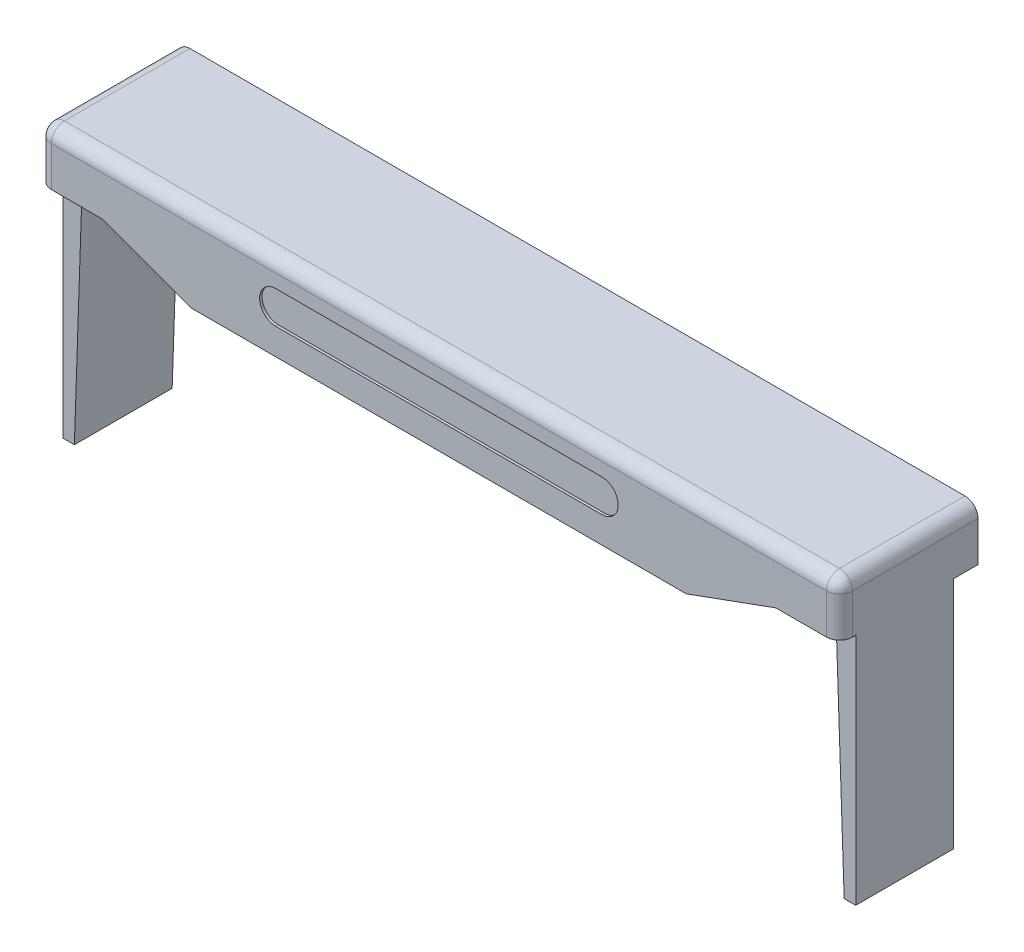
ISO-10303-21;
HEADER;
FILE_DESCRIPTION(('STEP AP214'),'2;1');
FILE_NAME('part.step','',(''),(''),'','','');
FILE_SCHEMA(('AUTOMOTIVE_DESIGN { 1 0 10303 214 1 1 1 1 }'));
ENDSEC;
DATA;
#1=APPLICATION_CONTEXT('core data for automotive mechanical design processes');
#2=APPLICATION_PROTOCOL_DEFINITION('international standard','automotive_design',2000,#1);
#3=PRODUCT_CONTEXT('',#1,'mechanical');
#4=PRODUCT('Part','Part','',(#3));
#5=PRODUCT_RELATED_PRODUCT_CATEGORY('part','',(#4));
#6=PRODUCT_DEFINITION_FORMATION('','',#4);
#7=PRODUCT_DEFINITION_CONTEXT('part definition',#1,'design');
#8=PRODUCT_DEFINITION('design','',#6,#7);
#9=PRODUCT_DEFINITION_SHAPE('','',#8);
#10=(LENGTH_UNIT() NAMED_UNIT(*) SI_UNIT(.MILLI.,.METRE.));
#11=(NAMED_UNIT(*) PLANE_ANGLE_UNIT() SI_UNIT($,.RADIAN.));
#12=(NAMED_UNIT(*) SI_UNIT($,.STERADIAN.) SOLID_ANGLE_UNIT());
#13=UNCERTAINTY_MEASURE_WITH_UNIT(LENGTH_MEASURE(1.E-05),#10,'distance_accuracy_value','');
#14=(GEOMETRIC_REPRESENTATION_CONTEXT(3) GLOBAL_UNCERTAINTY_ASSIGNED_CONTEXT((#13)) GLOBAL_UNIT_ASSIGNED_CONTEXT((#10,
#11,#12)) REPRESENTATION_CONTEXT('',''));
#15=CARTESIAN_POINT('',(0.,0.,0.));
#16=DIRECTION('',(0.,0.,1.));
#17=DIRECTION('',(1.,0.,0.));
#18=AXIS2_PLACEMENT_3D('',#15,#16,#17);
#19=CARTESIAN_POINT('',(0.,-4.,-5.5));
#20=DIRECTION('',(0.,0.,-1.));
#21=DIRECTION('',(0.,1.,0.));
#22=AXIS2_PLACEMENT_3D('',#19,#20,#21);
#23=PLANE('',#22);
#24=DIRECTION('',(-0.0340228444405,0.999421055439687,0.));
#25=VECTOR('',#24,1.);
#26=CARTESIAN_POINT('',(47.7270212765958,-28.7,-5.5));
#27=LINE('',#26,#25);
#28=CARTESIAN_POINT('',(47.7270212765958,-28.7,-5.5));
#29=VERTEX_POINT('',#28);
#30=CARTESIAN_POINT('',(46.75,0.,-5.5));
#31=VERTEX_POINT('',#30);
#32=EDGE_CURVE('E275',#29,#31,#27,.T.);
#33=ORIENTED_EDGE('',*,*,#32,.T.);
#34=DIRECTION('',(1.,0.,0.));
#35=VECTOR('',#34,1.);
#36=CARTESIAN_POINT('',(49.15,0.,-5.5));
#37=LINE('',#36,#35);
#38=CARTESIAN_POINT('',(49.15,0.,-5.5));
#39=VERTEX_POINT('',#38);
#40=EDGE_CURVE('E466',#31,#39,#37,.T.);
#41=ORIENTED_EDGE('',*,*,#40,.T.);
#42=DIRECTION('',(0.,-1.,0.));
#43=VECTOR('',#42,1.);
#44=CARTESIAN_POINT('',(49.15,0.,-5.5));
#45=LINE('',#44,#43);
#46=CARTESIAN_POINT('',(49.15,-28.7,-5.5));
#47=VERTEX_POINT('',#46);
#48=EDGE_CURVE('E359',#39,#47,#45,.T.);
#49=ORIENTED_EDGE('',*,*,#48,.T.);
#50=DIRECTION('',(-1.,0.,0.));
#51=VECTOR('',#50,1.);
#52=CARTESIAN_POINT('',(49.15,-28.7,-5.5));
#53=LINE('',#52,#51);
#54=EDGE_CURVE('E533',#47,#29,#53,.T.);
#55=ORIENTED_EDGE('',*,*,#54,.T.);
#56=EDGE_LOOP('',(#33,#41,#49,#55));
#57=FACE_BOUND('',#56,.T.);
#58=ADVANCED_FACE('F16',(#57),#23,.T.);
#59=CARTESIAN_POINT('',(0.,-4.,5.5));
#60=DIRECTION('',(0.,0.,1.));
#61=DIRECTION('',(1.,0.,0.));
#62=AXIS2_PLACEMENT_3D('',#59,#60,#61);
#63=PLANE('',#62);
#64=DIRECTION('',(0.0340228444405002,0.999421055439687,0.));
#65=VECTOR('',#64,1.);
#66=CARTESIAN_POINT('',(-47.7270212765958,-28.7,5.5));
#67=LINE('',#66,#65);
#68=CARTESIAN_POINT('',(-47.7270212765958,-28.7,5.5));
#69=VERTEX_POINT('',#68);
#70=CARTESIAN_POINT('',(-46.75,0.,5.5));
#71=VERTEX_POINT('',#70);
#72=EDGE_CURVE('E276',#69,#71,#67,.T.);
#73=ORIENTED_EDGE('',*,*,#72,.T.);
#74=DIRECTION('',(-1.,0.,0.));
#75=VECTOR('',#74,1.);
#76=CARTESIAN_POINT('',(-49.15,0.,5.5));
#77=LINE('',#76,#75);
#78=CARTESIAN_POINT('',(-49.15,0.,5.5));
#79=VERTEX_POINT('',#78);
#80=EDGE_CURVE('E441',#71,#79,#77,.T.);
#81=ORIENTED_EDGE('',*,*,#80,.T.);
#82=DIRECTION('',(0.,-1.,0.));
#83=VECTOR('',#82,1.);
#84=CARTESIAN_POINT('',(-49.15,0.,5.5));
#85=LINE('',#84,#83);
#86=CARTESIAN_POINT('',(-49.15,-28.7,5.5));
#87=VERTEX_POINT('',#86);
#88=EDGE_CURVE('E385',#79,#87,#85,.T.);
#89=ORIENTED_EDGE('',*,*,#88,.T.);
#90=DIRECTION('',(1.,0.,0.));
#91=VECTOR('',#90,1.);
#92=CARTESIAN_POINT('',(-49.15,-28.7,5.5));
#93=LINE('',#92,#91);
#94=EDGE_CURVE('E308',#87,#69,#93,.T.);
#95=ORIENTED_EDGE('',*,*,#94,.T.);
#96=EDGE_LOOP('',(#73,#81,#89,#95));
#97=FACE_BOUND('',#96,.T.);
#98=ADVANCED_FACE('F523',(#97),#63,.T.);
#99=CARTESIAN_POINT('',(20.,1.25,8.2));
#100=DIRECTION('',(0.,0.,-1.));
#101=DIRECTION('',(0.,1.,0.));
#102=AXIS2_PLACEMENT_3D('',#99,#100,#101);
#103=PLANE('',#102);
#104=CARTESIAN_POINT('',(20.,1.25,8.2));
#105=DIRECTION('',(0.,0.,-1.));
#106=DIRECTION('',(0.,1.,0.));
#107=AXIS2_PLACEMENT_3D('',#104,#105,#106);
#108=CIRCLE('',#107,2.);
#109=CARTESIAN_POINT('',(20.,3.25,8.2));
#110=VERTEX_POINT('',#109);
#111=CARTESIAN_POINT('',(20.,-0.75,8.2));
#112=VERTEX_POINT('',#111);
#113=EDGE_CURVE('E312',#110,#112,#108,.T.);
#114=ORIENTED_EDGE('',*,*,#113,.F.);
#115=DIRECTION('',(1.,0.,0.));
#116=VECTOR('',#115,1.);
#117=CARTESIAN_POINT('',(20.,3.25,8.2));
#118=LINE('',#117,#116);
#119=CARTESIAN_POINT('',(-20.,3.25,8.2));
#120=VERTEX_POINT('',#119);
#121=EDGE_CURVE('E11',#120,#110,#118,.T.);
#122=ORIENTED_EDGE('',*,*,#121,.F.);
#123=CARTESIAN_POINT('',(-20.,1.25,8.2));
#124=DIRECTION('',(0.,0.,-1.));
#125=DIRECTION('',(0.,1.,0.));
#126=AXIS2_PLACEMENT_3D('',#123,#124,#125);
#127=CIRCLE('',#126,2.);
#128=CARTESIAN_POINT('',(-20.,-0.75,8.2));
#129=VERTEX_POINT('',#128);
#130=EDGE_CURVE('E40',#129,#120,#127,.T.);
#131=ORIENTED_EDGE('',*,*,#130,.F.);
#132=DIRECTION('',(-1.,0.,0.));
#133=VECTOR('',#132,1.);
#134=CARTESIAN_POINT('',(20.,-0.75,8.2));
#135=LINE('',#134,#133);
#136=EDGE_CURVE('E487',#112,#129,#135,.T.);
#137=ORIENTED_EDGE('',*,*,#136,.F.);
#138=EDGE_LOOP('',(#114,#122,#131,#137));
#139=FACE_BOUND('',#138,.T.);
#140=ADVANCED_FACE('F507',(#139),#103,.F.);
#141=CARTESIAN_POINT('',(20.,3.25,8.2));
#142=DIRECTION('',(0.,-1.,0.));
#143=DIRECTION('',(0.,0.,-1.));
#144=AXIS2_PLACEMENT_3D('',#141,#142,#143);
#145=PLANE('',#144);
#146=DIRECTION('',(1.,0.,0.));
#147=VECTOR('',#146,1.);
#148=CARTESIAN_POINT('',(20.,3.25,8.5));
#149=LINE('',#148,#147);
#150=CARTESIAN_POINT('',(-20.,3.25,8.5));
#151=VERTEX_POINT('',#150);
#152=CARTESIAN_POINT('',(20.,3.25,8.5));
#153=VERTEX_POINT('',#152);
#154=EDGE_CURVE('E381',#151,#153,#149,.T.);
#155=ORIENTED_EDGE('',*,*,#154,.F.);
#156=DIRECTION('',(0.,0.,1.));
#157=VECTOR('',#156,1.);
#158=CARTESIAN_POINT('',(-20.,3.25,8.2));
#159=LINE('',#158,#157);
#160=EDGE_CURVE('E24',#120,#151,#159,.T.);
#161=ORIENTED_EDGE('',*,*,#160,.F.);
#162=ORIENTED_EDGE('',*,*,#121,.T.);
#163=DIRECTION('',(0.,0.,1.));
#164=VECTOR('',#163,1.);
#165=CARTESIAN_POINT('',(20.,3.25,8.2));
#166=LINE('',#165,#164);
#167=EDGE_CURVE('E309',#110,#153,#166,.T.);
#168=ORIENTED_EDGE('',*,*,#167,.T.);
#169=EDGE_LOOP('',(#155,#161,#162,#168));
#170=FACE_BOUND('',#169,.T.);
#171=ADVANCED_FACE('F499',(#170),#145,.T.);
#172=CARTESIAN_POINT('',(-20.,1.25,8.2));
#173=DIRECTION('',(0.,0.,1.));
#174=DIRECTION('',(0.,-1.,0.));
#175=AXIS2_PLACEMENT_3D('',#172,#173,#174);
#176=CYLINDRICAL_SURFACE('',#175,2.);
#177=CARTESIAN_POINT('',(-20.,1.25,8.5));
#178=DIRECTION('',(0.,0.,-1.));
#179=DIRECTION('',(0.,1.,0.));
#180=AXIS2_PLACEMENT_3D('',#177,#178,#179);
#181=CIRCLE('',#180,2.);
#182=CARTESIAN_POINT('',(-20.,-0.75,8.5));
#183=VERTEX_POINT('',#182);
#184=EDGE_CURVE('E377',#183,#151,#181,.T.);
#185=ORIENTED_EDGE('',*,*,#184,.F.);
#186=DIRECTION('',(0.,0.,1.));
#187=VECTOR('',#186,1.);
#188=CARTESIAN_POINT('',(-20.,-0.75,8.2));
#189=LINE('',#188,#187);
#190=EDGE_CURVE('E426',#129,#183,#189,.T.);
#191=ORIENTED_EDGE('',*,*,#190,.F.);
#192=ORIENTED_EDGE('',*,*,#130,.T.);
#193=ORIENTED_EDGE('',*,*,#160,.T.);
#194=EDGE_LOOP('',(#185,#191,#192,#193));
#195=FACE_BOUND('',#194,.T.);
#196=ADVANCED_FACE('F497',(#195),#176,.F.);
#197=CARTESIAN_POINT('',(20.,-0.75,8.2));
#198=DIRECTION('',(0.,1.,0.));
#199=DIRECTION('',(0.,0.,-1.));
#200=AXIS2_PLACEMENT_3D('',#197,#198,#199);
#201=PLANE('',#200);
#202=DIRECTION('',(-1.,0.,0.));
#203=VECTOR('',#202,1.);
#204=CARTESIAN_POINT('',(20.,-0.75,8.5));
#205=LINE('',#204,#203);
#206=CARTESIAN_POINT('',(20.,-0.75,8.5));
#207=VERTEX_POINT('',#206);
#208=EDGE_CURVE('E373',#207,#183,#205,.T.);
#209=ORIENTED_EDGE('',*,*,#208,.F.);
#210=DIRECTION('',(0.,0.,1.));
#211=VECTOR('',#210,1.);
#212=CARTESIAN_POINT('',(20.,-0.75,8.2));
#213=LINE('',#212,#211);
#214=EDGE_CURVE('E484',#112,#207,#213,.T.);
#215=ORIENTED_EDGE('',*,*,#214,.F.);
#216=ORIENTED_EDGE('',*,*,#136,.T.);
#217=ORIENTED_EDGE('',*,*,#190,.T.);
#218=EDGE_LOOP('',(#209,#215,#216,#217));
#219=FACE_BOUND('',#218,.T.);
#220=ADVANCED_FACE('F506',(#219),#201,.T.);
#221=CARTESIAN_POINT('',(20.,1.25,8.2));
#222=DIRECTION('',(0.,0.,1.));
#223=DIRECTION('',(0.,-1.,0.));
#224=AXIS2_PLACEMENT_3D('',#221,#222,#223);
#225=CYLINDRICAL_SURFACE('',#224,2.);
#226=CARTESIAN_POINT('',(20.,1.25,8.5));
#227=DIRECTION('',(0.,0.,-1.));
#228=DIRECTION('',(0.,1.,0.));
#229=AXIS2_PLACEMENT_3D('',#226,#227,#228);
#230=CIRCLE('',#229,2.);
#231=EDGE_CURVE('E369',#153,#207,#230,.T.);
#232=ORIENTED_EDGE('',*,*,#231,.F.);
#233=ORIENTED_EDGE('',*,*,#167,.F.);
#234=ORIENTED_EDGE('',*,*,#113,.T.);
#235=ORIENTED_EDGE('',*,*,#214,.T.);
#236=EDGE_LOOP('',(#232,#233,#234,#235));
#237=FACE_BOUND('',#236,.T.);
#238=ADVANCED_FACE('F509',(#237),#225,.F.);
#239=CARTESIAN_POINT('',(47.55,4.9,-8.5));
#240=DIRECTION('',(0.,0.,1.));
#241=DIRECTION('',(0.,-1.,0.));
#242=AXIS2_PLACEMENT_3D('',#239,#240,#241);
#243=CYLINDRICAL_SURFACE('',#242,1.6);
#244=CARTESIAN_POINT('',(47.55,4.9,-8.5));
#245=DIRECTION('',(0.,0.,-1.));
#246=DIRECTION('',(0.,1.,0.));
#247=AXIS2_PLACEMENT_3D('',#244,#245,#246);
#248=CIRCLE('',#247,1.6);
#249=CARTESIAN_POINT('',(47.55,6.5,-8.5));
#250=VERTEX_POINT('',#249);
#251=CARTESIAN_POINT('',(49.15,4.9,-8.5));
#252=VERTEX_POINT('',#251);
#253=EDGE_CURVE('E319',#250,#252,#248,.T.);
#254=ORIENTED_EDGE('',*,*,#253,.F.);
#255=DIRECTION('',(0.,0.,-1.));
#256=VECTOR('',#255,1.);
#257=CARTESIAN_POINT('',(47.55,6.5,-8.5));
#258=LINE('',#257,#256);
#259=CARTESIAN_POINT('',(47.55,6.5,6.9));
#260=VERTEX_POINT('',#259);
#261=EDGE_CURVE('E346',#260,#250,#258,.T.);
#262=ORIENTED_EDGE('',*,*,#261,.F.);
#263=CARTESIAN_POINT('',(47.55,4.9,6.9));
#264=DIRECTION('',(0.,0.,-1.));
#265=DIRECTION('',(0.,-1.,0.));
#266=AXIS2_PLACEMENT_3D('',#263,#264,#265);
#267=CIRCLE('',#266,1.6);
#268=CARTESIAN_POINT('',(49.15,4.9,6.9));
#269=VERTEX_POINT('',#268);
#270=EDGE_CURVE('E313',#260,#269,#267,.T.);
#271=ORIENTED_EDGE('',*,*,#270,.T.);
#272=DIRECTION('',(0.,0.,1.));
#273=VECTOR('',#272,1.);
#274=CARTESIAN_POINT('',(49.15,4.9,-8.5));
#275=LINE('',#274,#273);
#276=EDGE_CURVE('E451',#252,#269,#275,.T.);
#277=ORIENTED_EDGE('',*,*,#276,.F.);
#278=EDGE_LOOP('',(#254,#262,#271,#277));
#279=FACE_BOUND('',#278,.T.);
#280=ADVANCED_FACE('F511',(#279),#243,.T.);
#281=CARTESIAN_POINT('',(47.55,4.9,6.9));
#282=DIRECTION('',(0.,0.,1.));
#283=DIRECTION('',(1.,0.,0.));
#284=AXIS2_PLACEMENT_3D('',#281,#282,#283);
#285=SPHERICAL_SURFACE('',#284,1.6);
#286=CARTESIAN_POINT('',(47.55,4.9,6.9));
#287=DIRECTION('',(1.,0.,0.));
#288=DIRECTION('',(0.,1.,0.));
#289=AXIS2_PLACEMENT_3D('',#286,#287,#288);
#290=CIRCLE('',#289,1.6);
#291=CARTESIAN_POINT('',(47.55,4.9,8.5));
#292=VERTEX_POINT('',#291);
#293=EDGE_CURVE('E476',#260,#292,#290,.T.);
#294=ORIENTED_EDGE('',*,*,#293,.T.);
#295=CARTESIAN_POINT('',(47.55,4.9,6.9));
#296=DIRECTION('',(0.,1.,0.));
#297=DIRECTION('',(-1.,0.,0.));
#298=AXIS2_PLACEMENT_3D('',#295,#296,#297);
#299=CIRCLE('',#298,1.6);
#300=EDGE_CURVE('E246',#292,#269,#299,.T.);
#301=ORIENTED_EDGE('',*,*,#300,.T.);
#302=ORIENTED_EDGE('',*,*,#270,.F.);
#303=EDGE_LOOP('',(#294,#301,#302));
#304=FACE_BOUND('',#303,.T.);
#305=ADVANCED_FACE('F518',(#304),#285,.T.);
#306=CARTESIAN_POINT('',(-49.15,4.9,6.9));
#307=DIRECTION('',(1.,0.,0.));
#308=DIRECTION('',(0.,1.,0.));
#309=AXIS2_PLACEMENT_3D('',#306,#307,#308);
#310=CYLINDRICAL_SURFACE('',#309,1.6);
#311=CARTESIAN_POINT('',(-47.55,4.9,6.9));
#312=DIRECTION('',(1.,0.,0.));
#313=DIRECTION('',(0.,-1.,0.));
#314=AXIS2_PLACEMENT_3D('',#311,#312,#313);
#315=CIRCLE('',#314,1.6);
#316=CARTESIAN_POINT('',(-47.55,6.5,6.9));
#317=VERTEX_POINT('',#316);
#318=CARTESIAN_POINT('',(-47.55,4.9,8.5));
#319=VERTEX_POINT('',#318);
#320=EDGE_CURVE('E301',#317,#319,#315,.T.);
#321=ORIENTED_EDGE('',*,*,#320,.T.);
#322=DIRECTION('',(-1.,0.,0.));
#323=VECTOR('',#322,1.);
#324=CARTESIAN_POINT('',(-49.15,4.9,8.5));
#325=LINE('',#324,#323);
#326=EDGE_CURVE('E251',#292,#319,#325,.T.);
#327=ORIENTED_EDGE('',*,*,#326,.F.);
#328=ORIENTED_EDGE('',*,*,#293,.F.);
#329=DIRECTION('',(1.,0.,0.));
#330=VECTOR('',#329,1.);
#331=CARTESIAN_POINT('',(49.15,6.5,6.9));
#332=LINE('',#331,#330);
#333=EDGE_CURVE('E433',#317,#260,#332,.T.);
#334=ORIENTED_EDGE('',*,*,#333,.F.);
#335=EDGE_LOOP('',(#321,#327,#328,#334));
#336=FACE_BOUND('',#335,.T.);
#337=ADVANCED_FACE('F593',(#336),#310,.T.);
#338=CARTESIAN_POINT('',(47.55,-4.,6.9));
#339=DIRECTION('',(0.,1.,0.));
#340=DIRECTION('',(-1.,0.,0.));
#341=AXIS2_PLACEMENT_3D('',#338,#339,#340);
#342=CYLINDRICAL_SURFACE('',#341,1.6);
#343=CARTESIAN_POINT('',(47.55,0.,6.9));
#344=DIRECTION('',(0.,-1.,0.));
#345=DIRECTION('',(1.,0.,0.));
#346=AXIS2_PLACEMENT_3D('',#343,#344,#345);
#347=CIRCLE('',#346,1.6);
#348=CARTESIAN_POINT('',(49.15,0.,6.9));
#349=VERTEX_POINT('',#348);
#350=CARTESIAN_POINT('',(47.55,0.,8.5));
#351=VERTEX_POINT('',#350);
#352=EDGE_CURVE('E227',#349,#351,#347,.T.);
#353=ORIENTED_EDGE('',*,*,#352,.F.);
#354=DIRECTION('',(0.,-1.,0.));
#355=VECTOR('',#354,1.);
#356=CARTESIAN_POINT('',(49.15,0.,6.9));
#357=LINE('',#356,#355);
#358=EDGE_CURVE('E455',#269,#349,#357,.T.);
#359=ORIENTED_EDGE('',*,*,#358,.F.);
#360=ORIENTED_EDGE('',*,*,#300,.F.);
#361=DIRECTION('',(0.,1.,0.));
#362=VECTOR('',#361,1.);
#363=CARTESIAN_POINT('',(47.55,6.5,8.5));
#364=LINE('',#363,#362);
#365=EDGE_CURVE('E243',#351,#292,#364,.T.);
#366=ORIENTED_EDGE('',*,*,#365,.F.);
#367=EDGE_LOOP('',(#353,#359,#360,#366));
#368=FACE_BOUND('',#367,.T.);
#369=ADVANCED_FACE('F244',(#368),#342,.T.);
#370=CARTESIAN_POINT('',(-47.55,4.9,6.9));
#371=DIRECTION('',(0.,0.,1.));
#372=DIRECTION('',(1.,0.,0.));
#373=AXIS2_PLACEMENT_3D('',#370,#371,#372);
#374=SPHERICAL_SURFACE('',#373,1.6);
#375=CARTESIAN_POINT('',(-47.55,4.9,6.9));
#376=DIRECTION('',(0.,0.,1.));
#377=DIRECTION('',(0.,-1.,0.));
#378=AXIS2_PLACEMENT_3D('',#375,#376,#377);
#379=CIRCLE('',#378,1.6);
#380=CARTESIAN_POINT('',(-49.15,4.9,6.9));
#381=VERTEX_POINT('',#380);
#382=EDGE_CURVE('E298',#317,#381,#379,.T.);
#383=ORIENTED_EDGE('',*,*,#382,.T.);
#384=CARTESIAN_POINT('',(-47.55,4.9,6.9));
#385=DIRECTION('',(0.,1.,0.));
#386=DIRECTION('',(-1.,0.,0.));
#387=AXIS2_PLACEMENT_3D('',#384,#385,#386);
#388=CIRCLE('',#387,1.6);
#389=EDGE_CURVE('E238',#381,#319,#388,.T.);
#390=ORIENTED_EDGE('',*,*,#389,.T.);
#391=ORIENTED_EDGE('',*,*,#320,.F.);
#392=EDGE_LOOP('',(#383,#390,#391));
#393=FACE_BOUND('',#392,.T.);
#394=ADVANCED_FACE('F596',(#393),#374,.T.);
#395=CARTESIAN_POINT('',(-47.55,4.9,-8.5));
#396=DIRECTION('',(0.,0.,1.));
#397=DIRECTION('',(0.,-1.,0.));
#398=AXIS2_PLACEMENT_3D('',#395,#396,#397);
#399=CYLINDRICAL_SURFACE('',#398,1.6);
#400=CARTESIAN_POINT('',(-47.55,4.9,-8.5));
#401=DIRECTION('',(0.,0.,-1.));
#402=DIRECTION('',(0.,1.,0.));
#403=AXIS2_PLACEMENT_3D('',#400,#401,#402);
#404=CIRCLE('',#403,1.6);
#405=CARTESIAN_POINT('',(-49.15,4.9,-8.5));
#406=VERTEX_POINT('',#405);
#407=CARTESIAN_POINT('',(-47.55,6.5,-8.5));
#408=VERTEX_POINT('',#407);
#409=EDGE_CURVE('E429',#406,#408,#404,.T.);
#410=ORIENTED_EDGE('',*,*,#409,.F.);
#411=DIRECTION('',(0.,0.,-1.));
#412=VECTOR('',#411,1.);
#413=CARTESIAN_POINT('',(-49.15,4.9,-8.5));
#414=LINE('',#413,#412);
#415=EDGE_CURVE('E395',#381,#406,#414,.T.);
#416=ORIENTED_EDGE('',*,*,#415,.F.);
#417=ORIENTED_EDGE('',*,*,#382,.F.);
#418=DIRECTION('',(0.,0.,1.));
#419=VECTOR('',#418,1.);
#420=CARTESIAN_POINT('',(-47.55,6.5,-8.5));
#421=LINE('',#420,#419);
#422=EDGE_CURVE('E342',#408,#317,#421,.T.);
#423=ORIENTED_EDGE('',*,*,#422,.F.);
#424=EDGE_LOOP('',(#410,#416,#417,#423));
#425=FACE_BOUND('',#424,.T.);
#426=ADVANCED_FACE('F598',(#425),#399,.T.);
#427=CARTESIAN_POINT('',(-47.55,6.5,6.9));
#428=DIRECTION('',(0.,1.,0.));
#429=DIRECTION('',(-1.,0.,0.));
#430=AXIS2_PLACEMENT_3D('',#427,#428,#429);
#431=CYLINDRICAL_SURFACE('',#430,1.6);
#432=CARTESIAN_POINT('',(-47.55,0.,6.9));
#433=DIRECTION('',(0.,-1.,0.));
#434=DIRECTION('',(1.,0.,0.));
#435=AXIS2_PLACEMENT_3D('',#432,#433,#434);
#436=CIRCLE('',#435,1.6);
#437=CARTESIAN_POINT('',(-47.55,0.,8.5));
#438=VERTEX_POINT('',#437);
#439=CARTESIAN_POINT('',(-49.15,0.,6.9));
#440=VERTEX_POINT('',#439);
#441=EDGE_CURVE('E356',#438,#440,#436,.T.);
#442=ORIENTED_EDGE('',*,*,#441,.F.);
#443=DIRECTION('',(0.,-1.,0.));
#444=VECTOR('',#443,1.);
#445=CARTESIAN_POINT('',(-47.55,0.,8.5));
#446=LINE('',#445,#444);
#447=EDGE_CURVE('E350',#319,#438,#446,.T.);
#448=ORIENTED_EDGE('',*,*,#447,.F.);
#449=ORIENTED_EDGE('',*,*,#389,.F.);
#450=DIRECTION('',(0.,1.,0.));
#451=VECTOR('',#450,1.);
#452=CARTESIAN_POINT('',(-49.15,6.5,6.9));
#453=LINE('',#452,#451);
#454=EDGE_CURVE('E392',#440,#381,#453,.T.);
#455=ORIENTED_EDGE('',*,*,#454,.F.);
#456=EDGE_LOOP('',(#442,#448,#449,#455));
#457=FACE_BOUND('',#456,.T.);
#458=ADVANCED_FACE('F566',(#457),#431,.T.);
#459=CARTESIAN_POINT('',(0.,-4.,6.5));
#460=DIRECTION('',(0.,0.,1.));
#461=DIRECTION('',(1.,0.,0.));
#462=AXIS2_PLACEMENT_3D('',#459,#460,#461);
#463=PLANE('',#462);
#464=DIRECTION('',(-1.,0.,0.));
#465=VECTOR('',#464,1.);
#466=CARTESIAN_POINT('',(47.7270212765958,-28.7,6.5));
#467=LINE('',#466,#465);
#468=CARTESIAN_POINT('',(49.15,-28.7,6.5));
#469=VERTEX_POINT('',#468);
#470=CARTESIAN_POINT('',(47.7270212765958,-28.7,6.5));
#471=VERTEX_POINT('',#470);
#472=EDGE_CURVE('E270',#469,#471,#467,.T.);
#473=ORIENTED_EDGE('',*,*,#472,.F.);
#474=DIRECTION('',(0.,-1.,0.));
#475=VECTOR('',#474,1.);
#476=CARTESIAN_POINT('',(49.15,0.,6.5));
#477=LINE('',#476,#475);
#478=CARTESIAN_POINT('',(49.15,0.,6.5));
#479=VERTEX_POINT('',#478);
#480=EDGE_CURVE('E460',#479,#469,#477,.T.);
#481=ORIENTED_EDGE('',*,*,#480,.F.);
#482=DIRECTION('',(1.,0.,0.));
#483=VECTOR('',#482,1.);
#484=CARTESIAN_POINT('',(49.15,0.,6.5));
#485=LINE('',#484,#483);
#486=CARTESIAN_POINT('',(46.75,0.,6.5));
#487=VERTEX_POINT('',#486);
#488=EDGE_CURVE('E239',#487,#479,#485,.T.);
#489=ORIENTED_EDGE('',*,*,#488,.F.);
#490=DIRECTION('',(-0.0340228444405,0.999421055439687,0.));
#491=VECTOR('',#490,1.);
#492=CARTESIAN_POINT('',(47.7270212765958,-28.7,6.5));
#493=LINE('',#492,#491);
#494=EDGE_CURVE('E284',#471,#487,#493,.T.);
#495=ORIENTED_EDGE('',*,*,#494,.F.);
#496=EDGE_LOOP('',(#473,#481,#489,#495));
#497=FACE_BOUND('',#496,.T.);
#498=ADVANCED_FACE('F631',(#497),#463,.T.);
#499=CARTESIAN_POINT('',(41.3399096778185,0.,8.5));
#500=DIRECTION('',(0.,-1.,0.));
#501=DIRECTION('',(0.,0.,-1.));
#502=AXIS2_PLACEMENT_3D('',#499,#500,#501);
#503=PLANE('',#502);
#504=ORIENTED_EDGE('',*,*,#40,.F.);
#505=DIRECTION('',(0.,0.,-1.));
#506=VECTOR('',#505,1.);
#507=CARTESIAN_POINT('',(46.75,0.,6.5));
#508=LINE('',#507,#506);
#509=EDGE_CURVE('E296',#487,#31,#508,.T.);
#510=ORIENTED_EDGE('',*,*,#509,.F.);
#511=ORIENTED_EDGE('',*,*,#488,.T.);
#512=DIRECTION('',(0.,0.,-1.));
#513=VECTOR('',#512,1.);
#514=CARTESIAN_POINT('',(49.15,0.,8.5));
#515=LINE('',#514,#513);
#516=EDGE_CURVE('E233',#349,#479,#515,.T.);
#517=ORIENTED_EDGE('',*,*,#516,.F.);
#518=ORIENTED_EDGE('',*,*,#352,.T.);
#519=DIRECTION('',(1.,0.,0.));
#520=VECTOR('',#519,1.);
#521=CARTESIAN_POINT('',(41.3399096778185,0.,8.5));
#522=LINE('',#521,#520);
#523=CARTESIAN_POINT('',(41.3399096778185,0.,8.5));
#524=VERTEX_POINT('',#523);
#525=EDGE_CURVE('E231',#524,#351,#522,.T.);
#526=ORIENTED_EDGE('',*,*,#525,.F.);
#527=DIRECTION('',(0.,0.,-1.));
#528=VECTOR('',#527,1.);
#529=CARTESIAN_POINT('',(41.3399096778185,0.,8.5));
#530=LINE('',#529,#528);
#531=CARTESIAN_POINT('',(41.3399096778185,0.,-8.5));
#532=VERTEX_POINT('',#531);
#533=EDGE_CURVE('E463',#524,#532,#530,.T.);
#534=ORIENTED_EDGE('',*,*,#533,.T.);
#535=DIRECTION('',(1.,0.,0.));
#536=VECTOR('',#535,1.);
#537=CARTESIAN_POINT('',(49.15,0.,-8.5));
#538=LINE('',#537,#536);
#539=CARTESIAN_POINT('',(49.15,0.,-8.5));
#540=VERTEX_POINT('',#539);
#541=EDGE_CURVE('E318',#532,#540,#538,.T.);
#542=ORIENTED_EDGE('',*,*,#541,.T.);
#543=DIRECTION('',(0.,0.,-1.));
#544=VECTOR('',#543,1.);
#545=CARTESIAN_POINT('',(49.15,0.,8.5));
#546=LINE('',#545,#544);
#547=EDGE_CURVE('E448',#39,#540,#546,.T.);
#548=ORIENTED_EDGE('',*,*,#547,.F.);
#549=EDGE_LOOP('',(#504,#510,#511,#517,#518,#526,#534,#542,#548));
#550=FACE_BOUND('',#549,.T.);
#551=ADVANCED_FACE('F229',(#550),#503,.T.);
#552=CARTESIAN_POINT('',(30.35,-4.,8.5));
#553=DIRECTION('',(0.342020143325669,-0.939692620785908,0.));
#554=DIRECTION('',(0.,0.,-1.));
#555=AXIS2_PLACEMENT_3D('',#552,#553,#554);
#556=PLANE('',#555);
#557=DIRECTION('',(0.939692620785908,0.342020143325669,0.));
#558=VECTOR('',#557,1.);
#559=CARTESIAN_POINT('',(50.3254527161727,3.27047020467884,-8.5));
#560=LINE('',#559,#558);
#561=CARTESIAN_POINT('',(30.35,-4.,-8.5));
#562=VERTEX_POINT('',#561);
#563=EDGE_CURVE('E331',#562,#532,#560,.T.);
#564=ORIENTED_EDGE('',*,*,#563,.T.);
#565=ORIENTED_EDGE('',*,*,#533,.F.);
#566=DIRECTION('',(0.939692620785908,0.342020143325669,0.));
#567=VECTOR('',#566,1.);
#568=CARTESIAN_POINT('',(30.35,-4.,8.5));
#569=LINE('',#568,#567);
#570=CARTESIAN_POINT('',(30.35,-4.,8.5));
#571=VERTEX_POINT('',#570);
#572=EDGE_CURVE('E257',#571,#524,#569,.T.);
#573=ORIENTED_EDGE('',*,*,#572,.F.);
#574=DIRECTION('',(0.,0.,-1.));
#575=VECTOR('',#574,1.);
#576=CARTESIAN_POINT('',(30.35,-4.,8.5));
#577=LINE('',#576,#575);
#578=EDGE_CURVE('E412',#571,#562,#577,.T.);
#579=ORIENTED_EDGE('',*,*,#578,.T.);
#580=EDGE_LOOP('',(#564,#565,#573,#579));
#581=FACE_BOUND('',#580,.T.);
#582=ADVANCED_FACE('F580',(#581),#556,.T.);
#583=CARTESIAN_POINT('',(49.15,-4.,-8.5));
#584=DIRECTION('',(1.,0.,0.));
#585=DIRECTION('',(0.,0.,-1.));
#586=AXIS2_PLACEMENT_3D('',#583,#584,#585);
#587=PLANE('',#586);
#588=ORIENTED_EDGE('',*,*,#48,.F.);
#589=ORIENTED_EDGE('',*,*,#547,.T.);
#590=DIRECTION('',(0.,-1.,0.));
#591=VECTOR('',#590,1.);
#592=CARTESIAN_POINT('',(49.15,-4.,-8.5));
#593=LINE('',#592,#591);
#594=EDGE_CURVE('E314',#252,#540,#593,.T.);
#595=ORIENTED_EDGE('',*,*,#594,.F.);
#596=ORIENTED_EDGE('',*,*,#276,.T.);
#597=ORIENTED_EDGE('',*,*,#358,.T.);
#598=ORIENTED_EDGE('',*,*,#516,.T.);
#599=ORIENTED_EDGE('',*,*,#480,.T.);
#600=DIRECTION('',(0.,0.,-1.));
#601=VECTOR('',#600,1.);
#602=CARTESIAN_POINT('',(49.15,-28.7,6.5));
#603=LINE('',#602,#601);
#604=EDGE_CURVE('E544',#469,#47,#603,.T.);
#605=ORIENTED_EDGE('',*,*,#604,.T.);
#606=EDGE_LOOP('',(#588,#589,#595,#596,#597,#598,#599,#605));
#607=FACE_BOUND('',#606,.T.);
#608=ADVANCED_FACE('F587',(#607),#587,.T.);
#609=CARTESIAN_POINT('',(0.,-4.,-6.5));
#610=DIRECTION('',(0.,0.,1.));
#611=DIRECTION('',(1.,0.,0.));
#612=AXIS2_PLACEMENT_3D('',#609,#610,#611);
#613=PLANE('',#612);
#614=DIRECTION('',(1.,0.,0.));
#615=VECTOR('',#614,1.);
#616=CARTESIAN_POINT('',(-47.7270212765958,-28.7,-6.5));
#617=LINE('',#616,#615);
#618=CARTESIAN_POINT('',(-49.15,-28.7,-6.5));
#619=VERTEX_POINT('',#618);
#620=CARTESIAN_POINT('',(-47.7270212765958,-28.7,-6.5));
#621=VERTEX_POINT('',#620);
#622=EDGE_CURVE('E327',#619,#621,#617,.T.);
#623=ORIENTED_EDGE('',*,*,#622,.F.);
#624=DIRECTION('',(0.,-1.,0.));
#625=VECTOR('',#624,1.);
#626=CARTESIAN_POINT('',(-49.15,0.,-6.5));
#627=LINE('',#626,#625);
#628=CARTESIAN_POINT('',(-49.15,0.,-6.5));
#629=VERTEX_POINT('',#628);
#630=EDGE_CURVE('E292',#629,#619,#627,.T.);
#631=ORIENTED_EDGE('',*,*,#630,.F.);
#632=DIRECTION('',(-1.,0.,0.));
#633=VECTOR('',#632,1.);
#634=CARTESIAN_POINT('',(-49.15,0.,-6.5));
#635=LINE('',#634,#633);
#636=CARTESIAN_POINT('',(-46.75,0.,-6.5));
#637=VERTEX_POINT('',#636);
#638=EDGE_CURVE('E360',#637,#629,#635,.T.);
#639=ORIENTED_EDGE('',*,*,#638,.F.);
#640=DIRECTION('',(0.0340228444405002,0.999421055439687,0.));
#641=VECTOR('',#640,1.);
#642=CARTESIAN_POINT('',(-47.7270212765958,-28.7,-6.5));
#643=LINE('',#642,#641);
#644=EDGE_CURVE('E266',#621,#637,#643,.T.);
#645=ORIENTED_EDGE('',*,*,#644,.F.);
#646=EDGE_LOOP('',(#623,#631,#639,#645));
#647=FACE_BOUND('',#646,.T.);
#648=ADVANCED_FACE('F617',(#647),#613,.F.);
#649=CARTESIAN_POINT('',(-41.3399096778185,0.,8.5));
#650=DIRECTION('',(0.,-1.,0.));
#651=DIRECTION('',(0.,0.,-1.));
#652=AXIS2_PLACEMENT_3D('',#649,#650,#651);
#653=PLANE('',#652);
#654=ORIENTED_EDGE('',*,*,#80,.F.);
#655=DIRECTION('',(0.,0.,-1.));
#656=VECTOR('',#655,1.);
#657=CARTESIAN_POINT('',(-46.75,0.,6.5));
#658=LINE('',#657,#656);
#659=EDGE_CURVE('E259',#71,#637,#658,.T.);
#660=ORIENTED_EDGE('',*,*,#659,.T.);
#661=ORIENTED_EDGE('',*,*,#638,.T.);
#662=DIRECTION('',(0.,0.,-1.));
#663=VECTOR('',#662,1.);
#664=CARTESIAN_POINT('',(-49.15,0.,8.5));
#665=LINE('',#664,#663);
#666=CARTESIAN_POINT('',(-49.15,0.,-8.5));
#667=VERTEX_POINT('',#666);
#668=EDGE_CURVE('E288',#629,#667,#665,.T.);
#669=ORIENTED_EDGE('',*,*,#668,.T.);
#670=DIRECTION('',(-1.,0.,0.));
#671=VECTOR('',#670,1.);
#672=CARTESIAN_POINT('',(-49.15,0.,-8.5));
#673=LINE('',#672,#671);
#674=CARTESIAN_POINT('',(-41.3399096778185,0.,-8.5));
#675=VERTEX_POINT('',#674);
#676=EDGE_CURVE('E423',#675,#667,#673,.T.);
#677=ORIENTED_EDGE('',*,*,#676,.F.);
#678=DIRECTION('',(0.,0.,-1.));
#679=VECTOR('',#678,1.);
#680=CARTESIAN_POINT('',(-41.3399096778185,0.,8.5));
#681=LINE('',#680,#679);
#682=CARTESIAN_POINT('',(-41.3399096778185,0.,8.5));
#683=VERTEX_POINT('',#682);
#684=EDGE_CURVE('E345',#683,#675,#681,.T.);
#685=ORIENTED_EDGE('',*,*,#684,.F.);
#686=DIRECTION('',(-1.,0.,0.));
#687=VECTOR('',#686,1.);
#688=CARTESIAN_POINT('',(-41.3399096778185,0.,8.5));
#689=LINE('',#688,#687);
#690=EDGE_CURVE('E351',#683,#438,#689,.T.);
#691=ORIENTED_EDGE('',*,*,#690,.T.);
#692=ORIENTED_EDGE('',*,*,#441,.T.);
#693=DIRECTION('',(0.,0.,-1.));
#694=VECTOR('',#693,1.);
#695=CARTESIAN_POINT('',(-49.15,0.,8.5));
#696=LINE('',#695,#694);
#697=EDGE_CURVE('E388',#440,#79,#696,.T.);
#698=ORIENTED_EDGE('',*,*,#697,.T.);
#699=EDGE_LOOP('',(#654,#660,#661,#669,#677,#685,#691,#692,#698));
#700=FACE_BOUND('',#699,.T.);
#701=ADVANCED_FACE('F571',(#700),#653,.T.);
#702=CARTESIAN_POINT('',(-30.35,-4.,8.5));
#703=DIRECTION('',(-0.342020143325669,-0.939692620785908,0.));
#704=DIRECTION('',(0.,0.,1.));
#705=AXIS2_PLACEMENT_3D('',#702,#703,#704);
#706=PLANE('',#705);
#707=DIRECTION('',(-0.939692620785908,0.342020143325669,0.));
#708=VECTOR('',#707,1.);
#709=CARTESIAN_POINT('',(-50.3254527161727,3.27047020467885,-8.5));
#710=LINE('',#709,#708);
#711=CARTESIAN_POINT('',(-30.35,-4.,-8.5));
#712=VERTEX_POINT('',#711);
#713=EDGE_CURVE('E338',#712,#675,#710,.T.);
#714=ORIENTED_EDGE('',*,*,#713,.F.);
#715=DIRECTION('',(0.,0.,-1.));
#716=VECTOR('',#715,1.);
#717=CARTESIAN_POINT('',(-30.35,-4.,8.5));
#718=LINE('',#717,#716);
#719=CARTESIAN_POINT('',(-30.35,-4.,8.5));
#720=VERTEX_POINT('',#719);
#721=EDGE_CURVE('E304',#720,#712,#718,.T.);
#722=ORIENTED_EDGE('',*,*,#721,.F.);
#723=DIRECTION('',(-0.939692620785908,0.342020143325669,0.));
#724=VECTOR('',#723,1.);
#725=CARTESIAN_POINT('',(-30.35,-4.,8.5));
#726=LINE('',#725,#724);
#727=EDGE_CURVE('E355',#720,#683,#726,.T.);
#728=ORIENTED_EDGE('',*,*,#727,.T.);
#729=ORIENTED_EDGE('',*,*,#684,.T.);
#730=EDGE_LOOP('',(#714,#722,#728,#729));
#731=FACE_BOUND('',#730,.T.);
#732=ADVANCED_FACE('F574',(#731),#706,.T.);
#733=CARTESIAN_POINT('',(-49.15,6.5,-8.5));
#734=DIRECTION('',(0.,1.,0.));
#735=DIRECTION('',(0.,0.,-1.));
#736=AXIS2_PLACEMENT_3D('',#733,#734,#735);
#737=PLANE('',#736);
#738=ORIENTED_EDGE('',*,*,#333,.T.);
#739=ORIENTED_EDGE('',*,*,#261,.T.);
#740=DIRECTION('',(-1.,0.,0.));
#741=VECTOR('',#740,1.);
#742=CARTESIAN_POINT('',(-49.15,6.5,-8.5));
#743=LINE('',#742,#741);
#744=EDGE_CURVE('E413',#250,#408,#743,.T.);
#745=ORIENTED_EDGE('',*,*,#744,.T.);
#746=ORIENTED_EDGE('',*,*,#422,.T.);
#747=EDGE_LOOP('',(#738,#739,#745,#746));
#748=FACE_BOUND('',#747,.T.);
#749=ADVANCED_FACE('F600',(#748),#737,.T.);
#750=CARTESIAN_POINT('',(-49.15,6.5,-8.5));
#751=DIRECTION('',(0.,0.,-1.));
#752=DIRECTION('',(0.,1.,0.));
#753=AXIS2_PLACEMENT_3D('',#750,#751,#752);
#754=PLANE('',#753);
#755=ORIENTED_EDGE('',*,*,#744,.F.);
#756=ORIENTED_EDGE('',*,*,#253,.T.);
#757=ORIENTED_EDGE('',*,*,#594,.T.);
#758=ORIENTED_EDGE('',*,*,#541,.F.);
#759=ORIENTED_EDGE('',*,*,#563,.F.);
#760=DIRECTION('',(1.,0.,0.));
#761=VECTOR('',#760,1.);
#762=CARTESIAN_POINT('',(-49.15,-4.,-8.5));
#763=LINE('',#762,#761);
#764=EDGE_CURVE('E408',#712,#562,#763,.T.);
#765=ORIENTED_EDGE('',*,*,#764,.F.);
#766=ORIENTED_EDGE('',*,*,#713,.T.);
#767=ORIENTED_EDGE('',*,*,#676,.T.);
#768=DIRECTION('',(0.,-1.,0.));
#769=VECTOR('',#768,1.);
#770=CARTESIAN_POINT('',(-49.15,-4.,-8.5));
#771=LINE('',#770,#769);
#772=EDGE_CURVE('E293',#406,#667,#771,.T.);
#773=ORIENTED_EDGE('',*,*,#772,.F.);
#774=ORIENTED_EDGE('',*,*,#409,.T.);
#775=EDGE_LOOP('',(#755,#756,#757,#758,#759,#765,#766,#767,#773,#774));
#776=FACE_BOUND('',#775,.T.);
#777=ADVANCED_FACE('F585',(#776),#754,.T.);
#778=CARTESIAN_POINT('',(-49.15,-4.,-8.5));
#779=DIRECTION('',(0.,-1.,0.));
#780=DIRECTION('',(0.,0.,-1.));
#781=AXIS2_PLACEMENT_3D('',#778,#779,#780);
#782=PLANE('',#781);
#783=DIRECTION('',(1.,0.,0.));
#784=VECTOR('',#783,1.);
#785=CARTESIAN_POINT('',(-49.15,-4.,8.5));
#786=LINE('',#785,#784);
#787=EDGE_CURVE('E364',#720,#571,#786,.T.);
#788=ORIENTED_EDGE('',*,*,#787,.F.);
#789=ORIENTED_EDGE('',*,*,#721,.T.);
#790=ORIENTED_EDGE('',*,*,#764,.T.);
#791=ORIENTED_EDGE('',*,*,#578,.F.);
#792=EDGE_LOOP('',(#788,#789,#790,#791));
#793=FACE_BOUND('',#792,.T.);
#794=ADVANCED_FACE('F577',(#793),#782,.T.);
#795=CARTESIAN_POINT('',(-49.15,-4.,-8.5));
#796=DIRECTION('',(-1.,0.,0.));
#797=DIRECTION('',(0.,-1.,0.));
#798=AXIS2_PLACEMENT_3D('',#795,#796,#797);
#799=PLANE('',#798);
#800=ORIENTED_EDGE('',*,*,#88,.F.);
#801=ORIENTED_EDGE('',*,*,#697,.F.);
#802=ORIENTED_EDGE('',*,*,#454,.T.);
#803=ORIENTED_EDGE('',*,*,#415,.T.);
#804=ORIENTED_EDGE('',*,*,#772,.T.);
#805=ORIENTED_EDGE('',*,*,#668,.F.);
#806=ORIENTED_EDGE('',*,*,#630,.T.);
#807=DIRECTION('',(0.,0.,-1.));
#808=VECTOR('',#807,1.);
#809=CARTESIAN_POINT('',(-49.15,-28.7,6.5));
#810=LINE('',#809,#808);
#811=EDGE_CURVE('E323',#87,#619,#810,.T.);
#812=ORIENTED_EDGE('',*,*,#811,.F.);
#813=EDGE_LOOP('',(#800,#801,#802,#803,#804,#805,#806,#812));
#814=FACE_BOUND('',#813,.T.);
#815=ADVANCED_FACE('F605',(#814),#799,.T.);
#816=CARTESIAN_POINT('',(-49.15,6.5,8.5));
#817=DIRECTION('',(0.,0.,-1.));
#818=DIRECTION('',(0.,1.,0.));
#819=AXIS2_PLACEMENT_3D('',#816,#817,#818);
#820=PLANE('',#819);
#821=ORIENTED_EDGE('',*,*,#231,.T.);
#822=ORIENTED_EDGE('',*,*,#208,.T.);
#823=ORIENTED_EDGE('',*,*,#184,.T.);
#824=ORIENTED_EDGE('',*,*,#154,.T.);
#825=EDGE_LOOP('',(#821,#822,#823,#824));
#826=FACE_BOUND('',#825,.T.);
#827=ORIENTED_EDGE('',*,*,#525,.T.);
#828=ORIENTED_EDGE('',*,*,#365,.T.);
#829=ORIENTED_EDGE('',*,*,#326,.T.);
#830=ORIENTED_EDGE('',*,*,#447,.T.);
#831=ORIENTED_EDGE('',*,*,#690,.F.);
#832=ORIENTED_EDGE('',*,*,#727,.F.);
#833=ORIENTED_EDGE('',*,*,#787,.T.);
#834=ORIENTED_EDGE('',*,*,#572,.T.);
#835=EDGE_LOOP('',(#827,#828,#829,#830,#831,#832,#833,#834));
#836=FACE_BOUND('',#835,.T.);
#837=ADVANCED_FACE('F254',(#826,#836),#820,.F.);
#838=CARTESIAN_POINT('',(-47.7270212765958,-28.7,6.5));
#839=DIRECTION('',(-0.999421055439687,0.0340228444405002,0.));
#840=DIRECTION('',(-0.0340228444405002,-0.999421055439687,0.));
#841=AXIS2_PLACEMENT_3D('',#838,#839,#840);
#842=PLANE('',#841);
#843=ORIENTED_EDGE('',*,*,#72,.F.);
#844=DIRECTION('',(0.,0.,-1.));
#845=VECTOR('',#844,1.);
#846=CARTESIAN_POINT('',(-47.7270212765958,-28.7,6.5));
#847=LINE('',#846,#845);
#848=EDGE_CURVE('E280',#69,#621,#847,.T.);
#849=ORIENTED_EDGE('',*,*,#848,.T.);
#850=ORIENTED_EDGE('',*,*,#644,.T.);
#851=ORIENTED_EDGE('',*,*,#659,.F.);
#852=EDGE_LOOP('',(#843,#849,#850,#851));
#853=FACE_BOUND('',#852,.T.);
#854=ADVANCED_FACE('F609',(#853),#842,.F.);
#855=CARTESIAN_POINT('',(-47.7270212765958,-28.7,6.5));
#856=DIRECTION('',(0.,1.,0.));
#857=DIRECTION('',(0.,0.,-1.));
#858=AXIS2_PLACEMENT_3D('',#855,#856,#857);
#859=PLANE('',#858);
#860=ORIENTED_EDGE('',*,*,#94,.F.);
#861=ORIENTED_EDGE('',*,*,#811,.T.);
#862=ORIENTED_EDGE('',*,*,#622,.T.);
#863=ORIENTED_EDGE('',*,*,#848,.F.);
#864=EDGE_LOOP('',(#860,#861,#862,#863));
#865=FACE_BOUND('',#864,.T.);
#866=ADVANCED_FACE('F613',(#865),#859,.F.);
#867=CARTESIAN_POINT('',(47.7270212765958,-28.7,6.5));
#868=DIRECTION('',(0.999421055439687,0.0340228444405,0.));
#869=DIRECTION('',(0.,0.,-1.));
#870=AXIS2_PLACEMENT_3D('',#867,#868,#869);
#871=PLANE('',#870);
#872=ORIENTED_EDGE('',*,*,#32,.F.);
#873=DIRECTION('',(0.,0.,-1.));
#874=VECTOR('',#873,1.);
#875=CARTESIAN_POINT('',(47.7270212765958,-28.7,6.5));
#876=LINE('',#875,#874);
#877=EDGE_CURVE('E272',#471,#29,#876,.T.);
#878=ORIENTED_EDGE('',*,*,#877,.F.);
#879=ORIENTED_EDGE('',*,*,#494,.T.);
#880=ORIENTED_EDGE('',*,*,#509,.T.);
#881=EDGE_LOOP('',(#872,#878,#879,#880));
#882=FACE_BOUND('',#881,.T.);
#883=ADVANCED_FACE('F536',(#882),#871,.F.);
#884=CARTESIAN_POINT('',(47.7270212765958,-28.7,6.5));
#885=DIRECTION('',(0.,1.,0.));
#886=DIRECTION('',(0.,0.,-1.));
#887=AXIS2_PLACEMENT_3D('',#884,#885,#886);
#888=PLANE('',#887);
#889=ORIENTED_EDGE('',*,*,#54,.F.);
#890=ORIENTED_EDGE('',*,*,#604,.F.);
#891=ORIENTED_EDGE('',*,*,#472,.T.);
#892=ORIENTED_EDGE('',*,*,#877,.T.);
#893=EDGE_LOOP('',(#889,#890,#891,#892));
#894=FACE_BOUND('',#893,.T.);
#895=ADVANCED_FACE('F540',(#894),#888,.F.);
#896=CLOSED_SHELL('',(#58,#98,#140,#171,#196,#220,#238,#280,#305,#337,#369,#394,#426,#458,#498,
#551,#582,#608,#648,#701,#732,#749,#777,#794,#815,#837,#854,#866,#883,#895));
#897=MANIFOLD_SOLID_BREP('B1',#896);
#898=ADVANCED_BREP_SHAPE_REPRESENTATION('',(#18,#897),#14);
#899=SHAPE_DEFINITION_REPRESENTATION(#9,#898);
ENDSEC;
END-ISO-10303-21;
